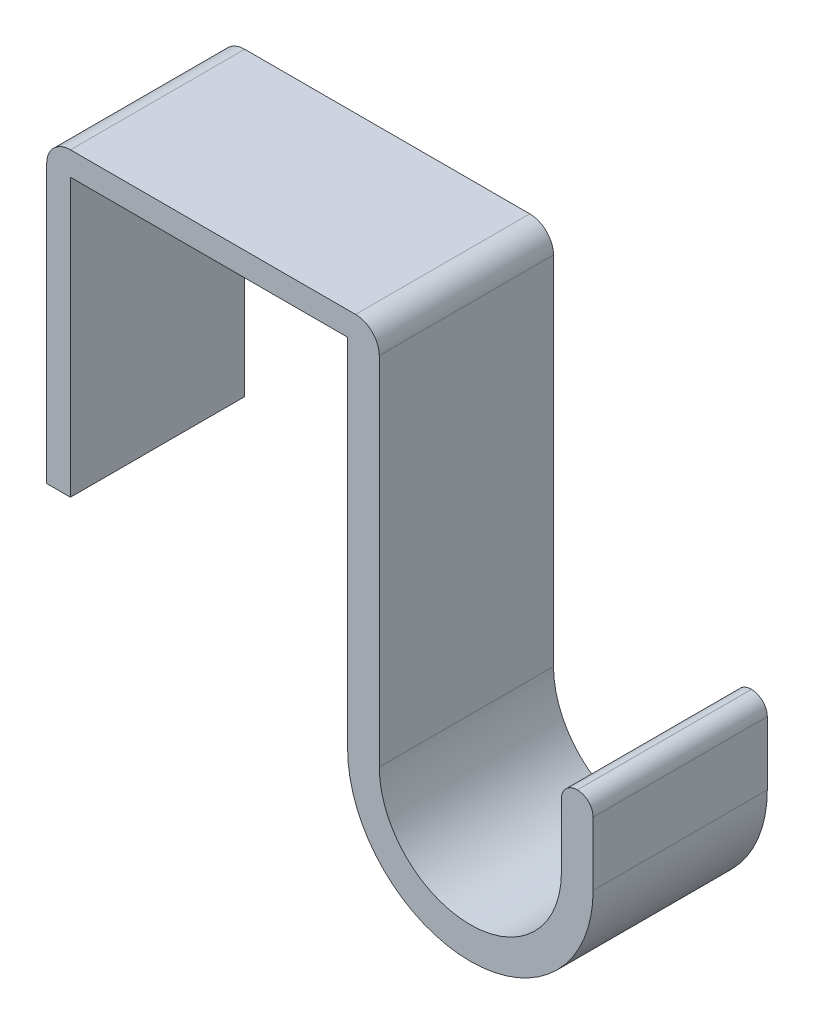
ISO-10303-21;
HEADER;
FILE_DESCRIPTION(('STEP AP214'),'2;1');
FILE_NAME('part.step','',(''),(''),'','','');
FILE_SCHEMA(('AUTOMOTIVE_DESIGN { 1 0 10303 214 1 1 1 1 }'));
ENDSEC;
DATA;
#1=APPLICATION_CONTEXT('core data for automotive mechanical design processes');
#2=APPLICATION_PROTOCOL_DEFINITION('international standard','automotive_design',2000,#1);
#3=PRODUCT_CONTEXT('',#1,'mechanical');
#4=PRODUCT('Part','Part','',(#3));
#5=PRODUCT_RELATED_PRODUCT_CATEGORY('part','',(#4));
#6=PRODUCT_DEFINITION_FORMATION('','',#4);
#7=PRODUCT_DEFINITION_CONTEXT('part definition',#1,'design');
#8=PRODUCT_DEFINITION('design','',#6,#7);
#9=PRODUCT_DEFINITION_SHAPE('','',#8);
#10=(LENGTH_UNIT() NAMED_UNIT(*) SI_UNIT(.MILLI.,.METRE.));
#11=(NAMED_UNIT(*) PLANE_ANGLE_UNIT() SI_UNIT($,.RADIAN.));
#12=(NAMED_UNIT(*) SI_UNIT($,.STERADIAN.) SOLID_ANGLE_UNIT());
#13=UNCERTAINTY_MEASURE_WITH_UNIT(LENGTH_MEASURE(1.E-05),#10,'distance_accuracy_value','');
#14=(GEOMETRIC_REPRESENTATION_CONTEXT(3) GLOBAL_UNCERTAINTY_ASSIGNED_CONTEXT((#13)) GLOBAL_UNIT_ASSIGNED_CONTEXT((#10,
#11,#12)) REPRESENTATION_CONTEXT('',''));
#15=CARTESIAN_POINT('',(0.,0.,0.));
#16=DIRECTION('',(0.,0.,1.));
#17=DIRECTION('',(1.,0.,0.));
#18=AXIS2_PLACEMENT_3D('',#15,#16,#17);
#19=CARTESIAN_POINT('',(0.,0.,22.));
#20=DIRECTION('',(1.,0.,0.));
#21=DIRECTION('',(0.,1.,0.));
#22=AXIS2_PLACEMENT_3D('',#19,#20,#21);
#23=PLANE('',#22);
#24=DIRECTION('',(0.,-1.,0.));
#25=VECTOR('',#24,1.);
#26=CARTESIAN_POINT('',(0.,0.,0.));
#27=LINE('',#26,#25);
#28=CARTESIAN_POINT('',(0.,0.,0.));
#29=VERTEX_POINT('',#28);
#30=CARTESIAN_POINT('',(0.,-45.,0.));
#31=VERTEX_POINT('',#30);
#32=EDGE_CURVE('E177',#29,#31,#27,.T.);
#33=ORIENTED_EDGE('',*,*,#32,.T.);
#34=DIRECTION('',(0.,0.,-1.));
#35=VECTOR('',#34,1.);
#36=CARTESIAN_POINT('',(0.,-45.,22.));
#37=LINE('',#36,#35);
#38=CARTESIAN_POINT('',(0.,-45.,22.));
#39=VERTEX_POINT('',#38);
#40=EDGE_CURVE('E11',#39,#31,#37,.T.);
#41=ORIENTED_EDGE('',*,*,#40,.F.);
#42=DIRECTION('',(0.,-1.,0.));
#43=VECTOR('',#42,1.);
#44=CARTESIAN_POINT('',(0.,0.,22.));
#45=LINE('',#44,#43);
#46=CARTESIAN_POINT('',(0.,0.,22.));
#47=VERTEX_POINT('',#46);
#48=EDGE_CURVE('E207',#47,#39,#45,.T.);
#49=ORIENTED_EDGE('',*,*,#48,.F.);
#50=DIRECTION('',(0.,0.,-1.));
#51=VECTOR('',#50,1.);
#52=CARTESIAN_POINT('',(0.,0.,22.));
#53=LINE('',#52,#51);
#54=EDGE_CURVE('E173',#47,#29,#53,.T.);
#55=ORIENTED_EDGE('',*,*,#54,.T.);
#56=EDGE_LOOP('',(#33,#41,#49,#55));
#57=FACE_BOUND('',#56,.T.);
#58=ADVANCED_FACE('F33',(#57),#23,.F.);
#59=CARTESIAN_POINT('',(15.5,-45.,22.));
#60=DIRECTION('',(0.,0.,-1.));
#61=DIRECTION('',(-1.,0.,0.));
#62=AXIS2_PLACEMENT_3D('',#59,#60,#61);
#63=CYLINDRICAL_SURFACE('',#62,15.5);
#64=CARTESIAN_POINT('',(15.5,-45.,0.));
#65=DIRECTION('',(0.,0.,1.));
#66=DIRECTION('',(1.,0.,0.));
#67=AXIS2_PLACEMENT_3D('',#64,#65,#66);
#68=CIRCLE('',#67,15.5);
#69=CARTESIAN_POINT('',(31.,-45.,0.));
#70=VERTEX_POINT('',#69);
#71=EDGE_CURVE('E180',#31,#70,#68,.T.);
#72=ORIENTED_EDGE('',*,*,#71,.T.);
#73=DIRECTION('',(0.,0.,-1.));
#74=VECTOR('',#73,1.);
#75=CARTESIAN_POINT('',(31.,-45.,22.));
#76=LINE('',#75,#74);
#77=CARTESIAN_POINT('',(31.,-45.,22.));
#78=VERTEX_POINT('',#77);
#79=EDGE_CURVE('E41',#78,#70,#76,.T.);
#80=ORIENTED_EDGE('',*,*,#79,.F.);
#81=CARTESIAN_POINT('',(15.5,-45.,22.));
#82=DIRECTION('',(0.,0.,1.));
#83=DIRECTION('',(1.,0.,0.));
#84=AXIS2_PLACEMENT_3D('',#81,#82,#83);
#85=CIRCLE('',#84,15.5);
#86=EDGE_CURVE('E116',#39,#78,#85,.T.);
#87=ORIENTED_EDGE('',*,*,#86,.F.);
#88=ORIENTED_EDGE('',*,*,#40,.T.);
#89=EDGE_LOOP('',(#72,#80,#87,#88));
#90=FACE_BOUND('',#89,.T.);
#91=ADVANCED_FACE('F305',(#90),#63,.T.);
#92=CARTESIAN_POINT('',(31.,-36.99,22.));
#93=DIRECTION('',(-1.,0.,0.));
#94=DIRECTION('',(0.,0.,1.));
#95=AXIS2_PLACEMENT_3D('',#92,#93,#94);
#96=PLANE('',#95);
#97=DIRECTION('',(0.,1.,0.));
#98=VECTOR('',#97,1.);
#99=CARTESIAN_POINT('',(31.,-36.99,0.));
#100=LINE('',#99,#98);
#101=CARTESIAN_POINT('',(31.,-36.99,0.));
#102=VERTEX_POINT('',#101);
#103=EDGE_CURVE('E182',#70,#102,#100,.T.);
#104=ORIENTED_EDGE('',*,*,#103,.T.);
#105=DIRECTION('',(0.,0.,-1.));
#106=VECTOR('',#105,1.);
#107=CARTESIAN_POINT('',(31.,-36.99,22.));
#108=LINE('',#107,#106);
#109=CARTESIAN_POINT('',(31.,-36.99,22.));
#110=VERTEX_POINT('',#109);
#111=EDGE_CURVE('E238',#110,#102,#108,.T.);
#112=ORIENTED_EDGE('',*,*,#111,.F.);
#113=DIRECTION('',(0.,1.,0.));
#114=VECTOR('',#113,1.);
#115=CARTESIAN_POINT('',(31.,-36.99,22.));
#116=LINE('',#115,#114);
#117=EDGE_CURVE('E246',#78,#110,#116,.T.);
#118=ORIENTED_EDGE('',*,*,#117,.F.);
#119=ORIENTED_EDGE('',*,*,#79,.T.);
#120=EDGE_LOOP('',(#104,#112,#118,#119));
#121=FACE_BOUND('',#120,.T.);
#122=ADVANCED_FACE('F244',(#121),#96,.F.);
#123=CARTESIAN_POINT('',(29.01,-36.99,22.));
#124=DIRECTION('',(0.,0.,-1.));
#125=DIRECTION('',(-1.,0.,0.));
#126=AXIS2_PLACEMENT_3D('',#123,#124,#125);
#127=CYLINDRICAL_SURFACE('',#126,1.99);
#128=CARTESIAN_POINT('',(29.01,-36.99,0.));
#129=DIRECTION('',(0.,0.,1.));
#130=DIRECTION('',(-1.,0.,0.));
#131=AXIS2_PLACEMENT_3D('',#128,#129,#130);
#132=CIRCLE('',#131,1.99);
#133=CARTESIAN_POINT('',(29.01,-35.,0.));
#134=VERTEX_POINT('',#133);
#135=EDGE_CURVE('E184',#102,#134,#132,.T.);
#136=ORIENTED_EDGE('',*,*,#135,.T.);
#137=DIRECTION('',(0.,0.,-1.));
#138=VECTOR('',#137,1.);
#139=CARTESIAN_POINT('',(29.01,-35.,22.));
#140=LINE('',#139,#138);
#141=CARTESIAN_POINT('',(29.01,-35.,22.));
#142=VERTEX_POINT('',#141);
#143=EDGE_CURVE('E235',#142,#134,#140,.T.);
#144=ORIENTED_EDGE('',*,*,#143,.F.);
#145=CARTESIAN_POINT('',(29.01,-36.99,22.));
#146=DIRECTION('',(0.,0.,1.));
#147=DIRECTION('',(-1.,0.,0.));
#148=AXIS2_PLACEMENT_3D('',#145,#146,#147);
#149=CIRCLE('',#148,1.99);
#150=EDGE_CURVE('E264',#110,#142,#149,.T.);
#151=ORIENTED_EDGE('',*,*,#150,.F.);
#152=ORIENTED_EDGE('',*,*,#111,.T.);
#153=EDGE_LOOP('',(#136,#144,#151,#152));
#154=FACE_BOUND('',#153,.T.);
#155=ADVANCED_FACE('F255',(#154),#127,.T.);
#156=CARTESIAN_POINT('',(28.99,-35.,22.));
#157=DIRECTION('',(0.,-1.,0.));
#158=DIRECTION('',(0.,0.,-1.));
#159=AXIS2_PLACEMENT_3D('',#156,#157,#158);
#160=PLANE('',#159);
#161=DIRECTION('',(-1.,0.,0.));
#162=VECTOR('',#161,1.);
#163=CARTESIAN_POINT('',(28.99,-35.,0.));
#164=LINE('',#163,#162);
#165=CARTESIAN_POINT('',(28.99,-35.,0.));
#166=VERTEX_POINT('',#165);
#167=EDGE_CURVE('E186',#134,#166,#164,.T.);
#168=ORIENTED_EDGE('',*,*,#167,.T.);
#169=DIRECTION('',(0.,0.,-1.));
#170=VECTOR('',#169,1.);
#171=CARTESIAN_POINT('',(28.99,-35.,22.));
#172=LINE('',#171,#170);
#173=CARTESIAN_POINT('',(28.99,-35.,22.));
#174=VERTEX_POINT('',#173);
#175=EDGE_CURVE('E232',#174,#166,#172,.T.);
#176=ORIENTED_EDGE('',*,*,#175,.F.);
#177=DIRECTION('',(-1.,0.,0.));
#178=VECTOR('',#177,1.);
#179=CARTESIAN_POINT('',(28.99,-35.,22.));
#180=LINE('',#179,#178);
#181=EDGE_CURVE('E261',#142,#174,#180,.T.);
#182=ORIENTED_EDGE('',*,*,#181,.F.);
#183=ORIENTED_EDGE('',*,*,#143,.T.);
#184=EDGE_LOOP('',(#168,#176,#182,#183));
#185=FACE_BOUND('',#184,.T.);
#186=ADVANCED_FACE('F259',(#185),#160,.F.);
#187=CARTESIAN_POINT('',(28.99,-36.99,22.));
#188=DIRECTION('',(0.,0.,-1.));
#189=DIRECTION('',(-1.,0.,0.));
#190=AXIS2_PLACEMENT_3D('',#187,#188,#189);
#191=CYLINDRICAL_SURFACE('',#190,1.99);
#192=CARTESIAN_POINT('',(28.99,-36.99,0.));
#193=DIRECTION('',(0.,0.,1.));
#194=DIRECTION('',(-1.,0.,0.));
#195=AXIS2_PLACEMENT_3D('',#192,#193,#194);
#196=CIRCLE('',#195,1.99);
#197=CARTESIAN_POINT('',(27.,-36.99,0.));
#198=VERTEX_POINT('',#197);
#199=EDGE_CURVE('E188',#166,#198,#196,.T.);
#200=ORIENTED_EDGE('',*,*,#199,.T.);
#201=DIRECTION('',(0.,0.,-1.));
#202=VECTOR('',#201,1.);
#203=CARTESIAN_POINT('',(27.,-36.99,22.));
#204=LINE('',#203,#202);
#205=CARTESIAN_POINT('',(27.,-36.99,22.));
#206=VERTEX_POINT('',#205);
#207=EDGE_CURVE('E229',#206,#198,#204,.T.);
#208=ORIENTED_EDGE('',*,*,#207,.F.);
#209=CARTESIAN_POINT('',(28.99,-36.99,22.));
#210=DIRECTION('',(0.,0.,1.));
#211=DIRECTION('',(-1.,0.,0.));
#212=AXIS2_PLACEMENT_3D('',#209,#210,#211);
#213=CIRCLE('',#212,1.99);
#214=EDGE_CURVE('E263',#174,#206,#213,.T.);
#215=ORIENTED_EDGE('',*,*,#214,.F.);
#216=ORIENTED_EDGE('',*,*,#175,.T.);
#217=EDGE_LOOP('',(#200,#208,#215,#216));
#218=FACE_BOUND('',#217,.T.);
#219=ADVANCED_FACE('F318',(#218),#191,.T.);
#220=CARTESIAN_POINT('',(27.,-45.,22.));
#221=DIRECTION('',(1.,0.,0.));
#222=DIRECTION('',(0.,1.,0.));
#223=AXIS2_PLACEMENT_3D('',#220,#221,#222);
#224=PLANE('',#223);
#225=DIRECTION('',(0.,-1.,0.));
#226=VECTOR('',#225,1.);
#227=CARTESIAN_POINT('',(27.,-45.,0.));
#228=LINE('',#227,#226);
#229=CARTESIAN_POINT('',(27.,-45.,0.));
#230=VERTEX_POINT('',#229);
#231=EDGE_CURVE('E190',#198,#230,#228,.T.);
#232=ORIENTED_EDGE('',*,*,#231,.T.);
#233=DIRECTION('',(0.,0.,-1.));
#234=VECTOR('',#233,1.);
#235=CARTESIAN_POINT('',(27.,-45.,22.));
#236=LINE('',#235,#234);
#237=CARTESIAN_POINT('',(27.,-45.,22.));
#238=VERTEX_POINT('',#237);
#239=EDGE_CURVE('E226',#238,#230,#236,.T.);
#240=ORIENTED_EDGE('',*,*,#239,.F.);
#241=DIRECTION('',(0.,-1.,0.));
#242=VECTOR('',#241,1.);
#243=CARTESIAN_POINT('',(27.,-45.,22.));
#244=LINE('',#243,#242);
#245=EDGE_CURVE('E266',#206,#238,#244,.T.);
#246=ORIENTED_EDGE('',*,*,#245,.F.);
#247=ORIENTED_EDGE('',*,*,#207,.T.);
#248=EDGE_LOOP('',(#232,#240,#246,#247));
#249=FACE_BOUND('',#248,.T.);
#250=ADVANCED_FACE('F321',(#249),#224,.F.);
#251=CARTESIAN_POINT('',(15.5,-45.,22.));
#252=DIRECTION('',(0.,0.,-1.));
#253=DIRECTION('',(-1.,0.,0.));
#254=AXIS2_PLACEMENT_3D('',#251,#252,#253);
#255=CYLINDRICAL_SURFACE('',#254,11.5);
#256=CARTESIAN_POINT('',(15.5,-45.,0.));
#257=DIRECTION('',(0.,0.,-1.));
#258=DIRECTION('',(1.,0.,0.));
#259=AXIS2_PLACEMENT_3D('',#256,#257,#258);
#260=CIRCLE('',#259,11.5);
#261=CARTESIAN_POINT('',(4.00000000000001,-45.,0.));
#262=VERTEX_POINT('',#261);
#263=EDGE_CURVE('E192',#230,#262,#260,.T.);
#264=ORIENTED_EDGE('',*,*,#263,.T.);
#265=DIRECTION('',(0.,0.,-1.));
#266=VECTOR('',#265,1.);
#267=CARTESIAN_POINT('',(4.00000000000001,-45.,22.));
#268=LINE('',#267,#266);
#269=CARTESIAN_POINT('',(4.00000000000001,-45.,22.));
#270=VERTEX_POINT('',#269);
#271=EDGE_CURVE('E223',#270,#262,#268,.T.);
#272=ORIENTED_EDGE('',*,*,#271,.F.);
#273=CARTESIAN_POINT('',(15.5,-45.,22.));
#274=DIRECTION('',(0.,0.,-1.));
#275=DIRECTION('',(1.,0.,0.));
#276=AXIS2_PLACEMENT_3D('',#273,#274,#275);
#277=CIRCLE('',#276,11.5);
#278=EDGE_CURVE('E272',#238,#270,#277,.T.);
#279=ORIENTED_EDGE('',*,*,#278,.F.);
#280=ORIENTED_EDGE('',*,*,#239,.T.);
#281=EDGE_LOOP('',(#264,#272,#279,#280));
#282=FACE_BOUND('',#281,.T.);
#283=ADVANCED_FACE('F325',(#282),#255,.F.);
#284=CARTESIAN_POINT('',(4.,0.,22.));
#285=DIRECTION('',(-1.,0.,0.));
#286=DIRECTION('',(0.,-1.,0.));
#287=AXIS2_PLACEMENT_3D('',#284,#285,#286);
#288=PLANE('',#287);
#289=DIRECTION('',(0.,1.,0.));
#290=VECTOR('',#289,1.);
#291=CARTESIAN_POINT('',(4.,0.,0.));
#292=LINE('',#291,#290);
#293=CARTESIAN_POINT('',(4.,0.,0.));
#294=VERTEX_POINT('',#293);
#295=EDGE_CURVE('E194',#262,#294,#292,.T.);
#296=ORIENTED_EDGE('',*,*,#295,.T.);
#297=DIRECTION('',(0.,0.,-1.));
#298=VECTOR('',#297,1.);
#299=CARTESIAN_POINT('',(4.,0.,22.));
#300=LINE('',#299,#298);
#301=CARTESIAN_POINT('',(4.,0.,22.));
#302=VERTEX_POINT('',#301);
#303=EDGE_CURVE('E220',#302,#294,#300,.T.);
#304=ORIENTED_EDGE('',*,*,#303,.F.);
#305=DIRECTION('',(0.,1.,0.));
#306=VECTOR('',#305,1.);
#307=CARTESIAN_POINT('',(4.,0.,22.));
#308=LINE('',#307,#306);
#309=EDGE_CURVE('E274',#270,#302,#308,.T.);
#310=ORIENTED_EDGE('',*,*,#309,.F.);
#311=ORIENTED_EDGE('',*,*,#271,.T.);
#312=EDGE_LOOP('',(#296,#304,#310,#311));
#313=FACE_BOUND('',#312,.T.);
#314=ADVANCED_FACE('F329',(#313),#288,.F.);
#315=CARTESIAN_POINT('',(0.999999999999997,0.,22.));
#316=DIRECTION('',(0.,0.,-1.));
#317=DIRECTION('',(-1.,0.,0.));
#318=AXIS2_PLACEMENT_3D('',#315,#316,#317);
#319=CYLINDRICAL_SURFACE('',#318,3.);
#320=CARTESIAN_POINT('',(0.999999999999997,0.,0.));
#321=DIRECTION('',(0.,0.,1.));
#322=DIRECTION('',(-1.,0.,0.));
#323=AXIS2_PLACEMENT_3D('',#320,#321,#322);
#324=CIRCLE('',#323,3.);
#325=CARTESIAN_POINT('',(0.999999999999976,3.,0.));
#326=VERTEX_POINT('',#325);
#327=EDGE_CURVE('E196',#294,#326,#324,.T.);
#328=ORIENTED_EDGE('',*,*,#327,.T.);
#329=DIRECTION('',(0.,0.,-1.));
#330=VECTOR('',#329,1.);
#331=CARTESIAN_POINT('',(0.999999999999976,3.,22.));
#332=LINE('',#331,#330);
#333=CARTESIAN_POINT('',(0.999999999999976,3.,22.));
#334=VERTEX_POINT('',#333);
#335=EDGE_CURVE('E217',#334,#326,#332,.T.);
#336=ORIENTED_EDGE('',*,*,#335,.F.);
#337=CARTESIAN_POINT('',(0.999999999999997,0.,22.));
#338=DIRECTION('',(0.,0.,1.));
#339=DIRECTION('',(-1.,0.,0.));
#340=AXIS2_PLACEMENT_3D('',#337,#338,#339);
#341=CIRCLE('',#340,3.);
#342=EDGE_CURVE('E276',#302,#334,#341,.T.);
#343=ORIENTED_EDGE('',*,*,#342,.F.);
#344=ORIENTED_EDGE('',*,*,#303,.T.);
#345=EDGE_LOOP('',(#328,#336,#343,#344));
#346=FACE_BOUND('',#345,.T.);
#347=ADVANCED_FACE('F333',(#346),#319,.T.);
#348=CARTESIAN_POINT('',(-35.,2.99999999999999,22.));
#349=DIRECTION('',(0.,-1.,0.));
#350=DIRECTION('',(1.,0.,0.));
#351=AXIS2_PLACEMENT_3D('',#348,#349,#350);
#352=PLANE('',#351);
#353=DIRECTION('',(-1.,0.,0.));
#354=VECTOR('',#353,1.);
#355=CARTESIAN_POINT('',(-35.,2.99999999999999,0.));
#356=LINE('',#355,#354);
#357=CARTESIAN_POINT('',(-35.,3.,0.));
#358=VERTEX_POINT('',#357);
#359=EDGE_CURVE('E198',#326,#358,#356,.T.);
#360=ORIENTED_EDGE('',*,*,#359,.T.);
#361=DIRECTION('',(0.,0.,-1.));
#362=VECTOR('',#361,1.);
#363=CARTESIAN_POINT('',(-35.,3.,22.));
#364=LINE('',#363,#362);
#365=CARTESIAN_POINT('',(-35.,3.,22.));
#366=VERTEX_POINT('',#365);
#367=EDGE_CURVE('E214',#366,#358,#364,.T.);
#368=ORIENTED_EDGE('',*,*,#367,.F.);
#369=DIRECTION('',(-1.,0.,0.));
#370=VECTOR('',#369,1.);
#371=CARTESIAN_POINT('',(-35.,2.99999999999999,22.));
#372=LINE('',#371,#370);
#373=EDGE_CURVE('E278',#334,#366,#372,.T.);
#374=ORIENTED_EDGE('',*,*,#373,.F.);
#375=ORIENTED_EDGE('',*,*,#335,.T.);
#376=EDGE_LOOP('',(#360,#368,#374,#375));
#377=FACE_BOUND('',#376,.T.);
#378=ADVANCED_FACE('F337',(#377),#352,.F.);
#379=CARTESIAN_POINT('',(-35.,0.,22.));
#380=DIRECTION('',(0.,0.,-1.));
#381=DIRECTION('',(-1.,0.,0.));
#382=AXIS2_PLACEMENT_3D('',#379,#380,#381);
#383=CYLINDRICAL_SURFACE('',#382,3.);
#384=CARTESIAN_POINT('',(-35.,0.,0.));
#385=DIRECTION('',(0.,0.,1.));
#386=DIRECTION('',(-1.,0.,0.));
#387=AXIS2_PLACEMENT_3D('',#384,#385,#386);
#388=CIRCLE('',#387,3.);
#389=CARTESIAN_POINT('',(-38.,0.,0.));
#390=VERTEX_POINT('',#389);
#391=EDGE_CURVE('E200',#358,#390,#388,.T.);
#392=ORIENTED_EDGE('',*,*,#391,.T.);
#393=DIRECTION('',(0.,0.,-1.));
#394=VECTOR('',#393,1.);
#395=CARTESIAN_POINT('',(-38.,0.,22.));
#396=LINE('',#395,#394);
#397=CARTESIAN_POINT('',(-38.,0.,22.));
#398=VERTEX_POINT('',#397);
#399=EDGE_CURVE('E211',#398,#390,#396,.T.);
#400=ORIENTED_EDGE('',*,*,#399,.F.);
#401=CARTESIAN_POINT('',(-35.,0.,22.));
#402=DIRECTION('',(0.,0.,1.));
#403=DIRECTION('',(-1.,0.,0.));
#404=AXIS2_PLACEMENT_3D('',#401,#402,#403);
#405=CIRCLE('',#404,3.);
#406=EDGE_CURVE('E280',#366,#398,#405,.T.);
#407=ORIENTED_EDGE('',*,*,#406,.F.);
#408=ORIENTED_EDGE('',*,*,#367,.T.);
#409=EDGE_LOOP('',(#392,#400,#407,#408));
#410=FACE_BOUND('',#409,.T.);
#411=ADVANCED_FACE('F286',(#410),#383,.T.);
#412=CARTESIAN_POINT('',(-38.,-35.,22.));
#413=DIRECTION('',(1.,0.,0.));
#414=DIRECTION('',(0.,0.,-1.));
#415=AXIS2_PLACEMENT_3D('',#412,#413,#414);
#416=PLANE('',#415);
#417=DIRECTION('',(0.,-1.,0.));
#418=VECTOR('',#417,1.);
#419=CARTESIAN_POINT('',(-38.,-35.,0.));
#420=LINE('',#419,#418);
#421=CARTESIAN_POINT('',(-38.,-35.,0.));
#422=VERTEX_POINT('',#421);
#423=EDGE_CURVE('E202',#390,#422,#420,.T.);
#424=ORIENTED_EDGE('',*,*,#423,.T.);
#425=DIRECTION('',(0.,0.,-1.));
#426=VECTOR('',#425,1.);
#427=CARTESIAN_POINT('',(-38.,-35.,22.));
#428=LINE('',#427,#426);
#429=CARTESIAN_POINT('',(-38.,-35.,22.));
#430=VERTEX_POINT('',#429);
#431=EDGE_CURVE('E168',#430,#422,#428,.T.);
#432=ORIENTED_EDGE('',*,*,#431,.F.);
#433=DIRECTION('',(0.,-1.,0.));
#434=VECTOR('',#433,1.);
#435=CARTESIAN_POINT('',(-38.,-35.,22.));
#436=LINE('',#435,#434);
#437=EDGE_CURVE('E159',#398,#430,#436,.T.);
#438=ORIENTED_EDGE('',*,*,#437,.F.);
#439=ORIENTED_EDGE('',*,*,#399,.T.);
#440=EDGE_LOOP('',(#424,#432,#438,#439));
#441=FACE_BOUND('',#440,.T.);
#442=ADVANCED_FACE('F290',(#441),#416,.F.);
#443=CARTESIAN_POINT('',(-35.,-35.,22.));
#444=DIRECTION('',(0.,1.,0.));
#445=DIRECTION('',(-1.,0.,0.));
#446=AXIS2_PLACEMENT_3D('',#443,#444,#445);
#447=PLANE('',#446);
#448=DIRECTION('',(1.,0.,0.));
#449=VECTOR('',#448,1.);
#450=CARTESIAN_POINT('',(-35.,-35.,0.));
#451=LINE('',#450,#449);
#452=CARTESIAN_POINT('',(-35.,-35.,0.));
#453=VERTEX_POINT('',#452);
#454=EDGE_CURVE('E167',#422,#453,#451,.T.);
#455=ORIENTED_EDGE('',*,*,#454,.T.);
#456=DIRECTION('',(0.,0.,-1.));
#457=VECTOR('',#456,1.);
#458=CARTESIAN_POINT('',(-35.,-35.,22.));
#459=LINE('',#458,#457);
#460=CARTESIAN_POINT('',(-35.,-35.,22.));
#461=VERTEX_POINT('',#460);
#462=EDGE_CURVE('E164',#461,#453,#459,.T.);
#463=ORIENTED_EDGE('',*,*,#462,.F.);
#464=DIRECTION('',(1.,0.,0.));
#465=VECTOR('',#464,1.);
#466=CARTESIAN_POINT('',(-35.,-35.,22.));
#467=LINE('',#466,#465);
#468=EDGE_CURVE('E153',#430,#461,#467,.T.);
#469=ORIENTED_EDGE('',*,*,#468,.F.);
#470=ORIENTED_EDGE('',*,*,#431,.T.);
#471=EDGE_LOOP('',(#455,#463,#469,#470));
#472=FACE_BOUND('',#471,.T.);
#473=ADVANCED_FACE('F165',(#472),#447,.F.);
#474=CARTESIAN_POINT('',(-35.,0.,22.));
#475=DIRECTION('',(-1.,0.,0.));
#476=DIRECTION('',(0.,-1.,0.));
#477=AXIS2_PLACEMENT_3D('',#474,#475,#476);
#478=PLANE('',#477);
#479=DIRECTION('',(0.,1.,0.));
#480=VECTOR('',#479,1.);
#481=CARTESIAN_POINT('',(-35.,0.,0.));
#482=LINE('',#481,#480);
#483=CARTESIAN_POINT('',(-35.,0.,0.));
#484=VERTEX_POINT('',#483);
#485=EDGE_CURVE('E102',#453,#484,#482,.T.);
#486=ORIENTED_EDGE('',*,*,#485,.T.);
#487=DIRECTION('',(0.,0.,-1.));
#488=VECTOR('',#487,1.);
#489=CARTESIAN_POINT('',(-35.,0.,22.));
#490=LINE('',#489,#488);
#491=CARTESIAN_POINT('',(-35.,0.,22.));
#492=VERTEX_POINT('',#491);
#493=EDGE_CURVE('E169',#492,#484,#490,.T.);
#494=ORIENTED_EDGE('',*,*,#493,.F.);
#495=DIRECTION('',(0.,1.,0.));
#496=VECTOR('',#495,1.);
#497=CARTESIAN_POINT('',(-35.,0.,22.));
#498=LINE('',#497,#496);
#499=EDGE_CURVE('E157',#461,#492,#498,.T.);
#500=ORIENTED_EDGE('',*,*,#499,.F.);
#501=ORIENTED_EDGE('',*,*,#462,.T.);
#502=EDGE_LOOP('',(#486,#494,#500,#501));
#503=FACE_BOUND('',#502,.T.);
#504=ADVANCED_FACE('F171',(#503),#478,.F.);
#505=CARTESIAN_POINT('',(0.,0.,22.));
#506=DIRECTION('',(0.,1.,0.));
#507=DIRECTION('',(-1.,0.,0.));
#508=AXIS2_PLACEMENT_3D('',#505,#506,#507);
#509=PLANE('',#508);
#510=DIRECTION('',(1.,0.,0.));
#511=VECTOR('',#510,1.);
#512=CARTESIAN_POINT('',(0.,0.,0.));
#513=LINE('',#512,#511);
#514=EDGE_CURVE('E108',#484,#29,#513,.T.);
#515=ORIENTED_EDGE('',*,*,#514,.T.);
#516=ORIENTED_EDGE('',*,*,#54,.F.);
#517=DIRECTION('',(1.,0.,0.));
#518=VECTOR('',#517,1.);
#519=CARTESIAN_POINT('',(0.,0.,22.));
#520=LINE('',#519,#518);
#521=EDGE_CURVE('E49',#492,#47,#520,.T.);
#522=ORIENTED_EDGE('',*,*,#521,.F.);
#523=ORIENTED_EDGE('',*,*,#493,.T.);
#524=EDGE_LOOP('',(#515,#516,#522,#523));
#525=FACE_BOUND('',#524,.T.);
#526=ADVANCED_FACE('F294',(#525),#509,.F.);
#527=CARTESIAN_POINT('',(15.5,-45.,22.));
#528=DIRECTION('',(0.,0.,1.));
#529=DIRECTION('',(1.,0.,0.));
#530=AXIS2_PLACEMENT_3D('',#527,#528,#529);
#531=PLANE('',#530);
#532=ORIENTED_EDGE('',*,*,#48,.T.);
#533=ORIENTED_EDGE('',*,*,#86,.T.);
#534=ORIENTED_EDGE('',*,*,#117,.T.);
#535=ORIENTED_EDGE('',*,*,#150,.T.);
#536=ORIENTED_EDGE('',*,*,#181,.T.);
#537=ORIENTED_EDGE('',*,*,#214,.T.);
#538=ORIENTED_EDGE('',*,*,#245,.T.);
#539=ORIENTED_EDGE('',*,*,#278,.T.);
#540=ORIENTED_EDGE('',*,*,#309,.T.);
#541=ORIENTED_EDGE('',*,*,#342,.T.);
#542=ORIENTED_EDGE('',*,*,#373,.T.);
#543=ORIENTED_EDGE('',*,*,#406,.T.);
#544=ORIENTED_EDGE('',*,*,#437,.T.);
#545=ORIENTED_EDGE('',*,*,#468,.T.);
#546=ORIENTED_EDGE('',*,*,#499,.T.);
#547=ORIENTED_EDGE('',*,*,#521,.T.);
#548=EDGE_LOOP('',(#532,#533,#534,#535,#536,#537,#538,#539,#540,#541,#542,#543,#544,#545,#546,#547));
#549=FACE_BOUND('',#548,.T.);
#550=ADVANCED_FACE('F155',(#549),#531,.T.);
#551=CARTESIAN_POINT('',(15.5,-45.,0.));
#552=DIRECTION('',(0.,0.,1.));
#553=DIRECTION('',(1.,0.,0.));
#554=AXIS2_PLACEMENT_3D('',#551,#552,#553);
#555=PLANE('',#554);
#556=ORIENTED_EDGE('',*,*,#32,.F.);
#557=ORIENTED_EDGE('',*,*,#514,.F.);
#558=ORIENTED_EDGE('',*,*,#485,.F.);
#559=ORIENTED_EDGE('',*,*,#454,.F.);
#560=ORIENTED_EDGE('',*,*,#423,.F.);
#561=ORIENTED_EDGE('',*,*,#391,.F.);
#562=ORIENTED_EDGE('',*,*,#359,.F.);
#563=ORIENTED_EDGE('',*,*,#327,.F.);
#564=ORIENTED_EDGE('',*,*,#295,.F.);
#565=ORIENTED_EDGE('',*,*,#263,.F.);
#566=ORIENTED_EDGE('',*,*,#231,.F.);
#567=ORIENTED_EDGE('',*,*,#199,.F.);
#568=ORIENTED_EDGE('',*,*,#167,.F.);
#569=ORIENTED_EDGE('',*,*,#135,.F.);
#570=ORIENTED_EDGE('',*,*,#103,.F.);
#571=ORIENTED_EDGE('',*,*,#71,.F.);
#572=EDGE_LOOP('',(#556,#557,#558,#559,#560,#561,#562,#563,#564,#565,#566,#567,#568,#569,#570,#571));
#573=FACE_BOUND('',#572,.T.);
#574=ADVANCED_FACE('F250',(#573),#555,.F.);
#575=CLOSED_SHELL('',(#58,#91,#122,#155,#186,#219,#250,#283,#314,#347,#378,#411,#442,#473,#504,
#526,#550,#574));
#576=MANIFOLD_SOLID_BREP('B2',#575);
#577=ADVANCED_BREP_SHAPE_REPRESENTATION('',(#18,#576),#14);
#578=SHAPE_DEFINITION_REPRESENTATION(#9,#577);
ENDSEC;
END-ISO-10303-21;
